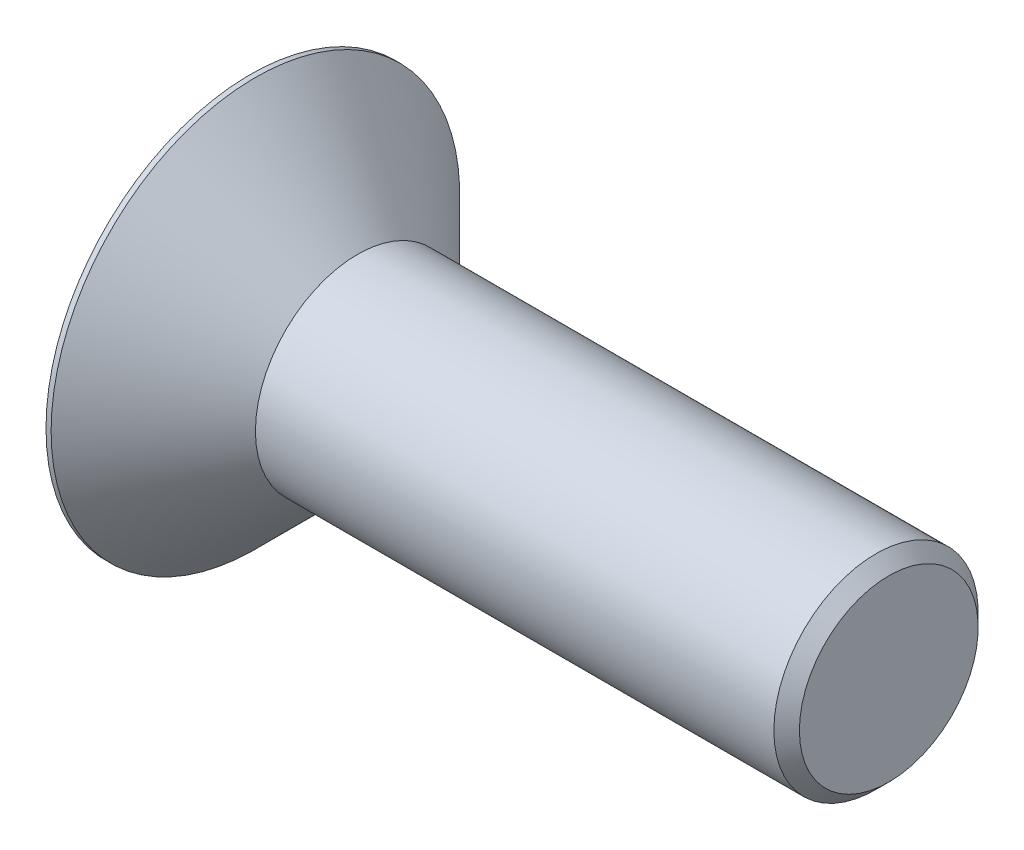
from build123d import *

# Parameters (mm, degrees)
FASE1_SIZE                      = 0.5
SCHNITT_LINEAR_AUSTRAGEN1_DEPTH = 2.5


with BuildPart() as part:
    # Skizze1 → Rotation1 (revolve)
    with BuildSketch(Plane.XY, mode=Mode.PRIVATE) as rotation1_sk:
        Polygon((0, 0), (0, 8), (0.2, 8), (4.2, 4), (25, 4), (25, 0), align=None)
    revolve(rotation1_sk.sketch.rotate(Axis((0, 0, 0), (1, 0, 0)), 90), axis=Axis((0, 0, 0), (1, 0, 0)))

    # Fase1
    fase1_edges = [part.edges().sort_by_distance(p)[0] for p in [
        (25, 0, -4),
    ]]
    chamfer(fase1_edges, length=FASE1_SIZE)

    # Skizze2 → Schnitt-Linear austragen1 (cut)
    with BuildSketch(Plane.ZY):
        Polygon((2.3377107, 1.693647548), (-0.297886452, 2.871340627), (-2.635597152, 1.177693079), (-2.3377107, -1.693647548), (0.297886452, -2.871340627), (2.635597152, -1.177693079), align=None)
    extrude(amount=-SCHNITT_LINEAR_AUSTRAGEN1_DEPTH, mode=Mode.SUBTRACT)


solid = part.part
